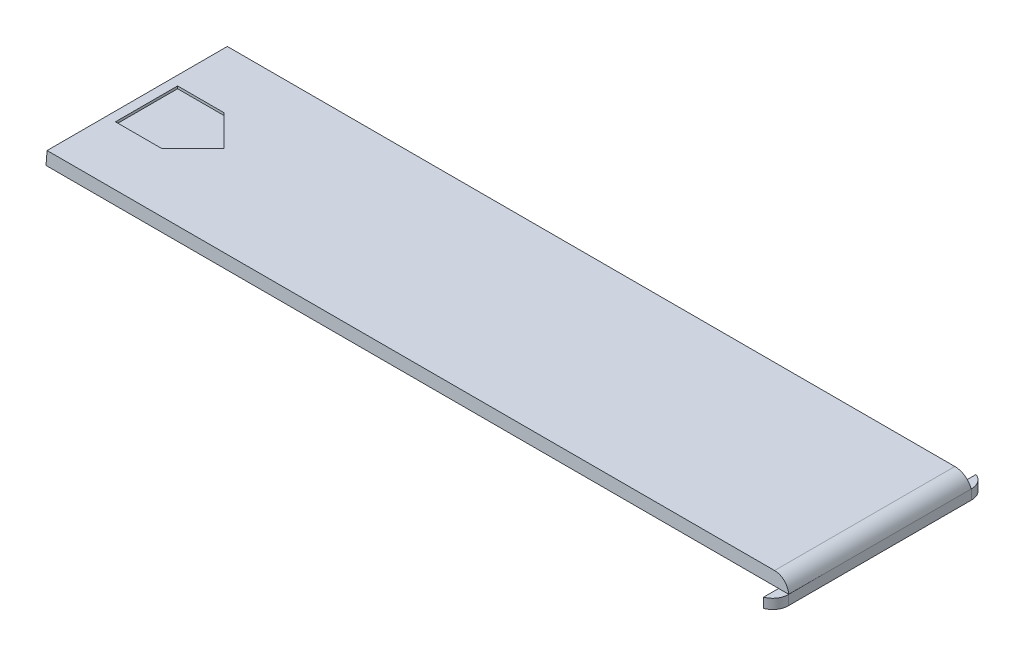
ISO-10303-21;
HEADER;
FILE_DESCRIPTION(('STEP AP214'),'2;1');
FILE_NAME('part.step','',(''),(''),'','','');
FILE_SCHEMA(('AUTOMOTIVE_DESIGN { 1 0 10303 214 1 1 1 1 }'));
ENDSEC;
DATA;
#1=APPLICATION_CONTEXT('core data for automotive mechanical design processes');
#2=APPLICATION_PROTOCOL_DEFINITION('international standard','automotive_design',2000,#1);
#3=PRODUCT_CONTEXT('',#1,'mechanical');
#4=PRODUCT('Part','Part','',(#3));
#5=PRODUCT_RELATED_PRODUCT_CATEGORY('part','',(#4));
#6=PRODUCT_DEFINITION_FORMATION('','',#4);
#7=PRODUCT_DEFINITION_CONTEXT('part definition',#1,'design');
#8=PRODUCT_DEFINITION('design','',#6,#7);
#9=PRODUCT_DEFINITION_SHAPE('','',#8);
#10=(LENGTH_UNIT() NAMED_UNIT(*) SI_UNIT(.MILLI.,.METRE.));
#11=(NAMED_UNIT(*) PLANE_ANGLE_UNIT() SI_UNIT($,.RADIAN.));
#12=(NAMED_UNIT(*) SI_UNIT($,.STERADIAN.) SOLID_ANGLE_UNIT());
#13=UNCERTAINTY_MEASURE_WITH_UNIT(LENGTH_MEASURE(1.E-05),#10,'distance_accuracy_value','');
#14=(GEOMETRIC_REPRESENTATION_CONTEXT(3) GLOBAL_UNCERTAINTY_ASSIGNED_CONTEXT((#13)) GLOBAL_UNIT_ASSIGNED_CONTEXT((#10,
#11,#12)) REPRESENTATION_CONTEXT('',''));
#15=CARTESIAN_POINT('',(0.,0.,0.));
#16=DIRECTION('',(0.,0.,1.));
#17=DIRECTION('',(1.,0.,0.));
#18=AXIS2_PLACEMENT_3D('',#15,#16,#17);
#19=CARTESIAN_POINT('',(0.,0.,0.));
#20=DIRECTION('',(0.,-1.,0.));
#21=DIRECTION('',(0.,0.,-1.));
#22=AXIS2_PLACEMENT_3D('',#19,#20,#21);
#23=PLANE('',#22);
#24=DIRECTION('',(1.,0.,0.));
#25=VECTOR('',#24,1.);
#26=CARTESIAN_POINT('',(-121.868681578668,0.,-11.3537769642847));
#27=LINE('',#26,#25);
#28=CARTESIAN_POINT('',(-121.412,0.,-11.3537769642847));
#29=VERTEX_POINT('',#28);
#30=CARTESIAN_POINT('',(-120.344681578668,0.,-11.3537769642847));
#31=VERTEX_POINT('',#30);
#32=EDGE_CURVE('E257',#29,#31,#27,.T.);
#33=ORIENTED_EDGE('',*,*,#32,.T.);
#34=CARTESIAN_POINT('',(-120.344681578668,0.,-12.6237769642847));
#35=DIRECTION('',(0.,1.,0.));
#36=DIRECTION('',(0.,0.,1.));
#37=AXIS2_PLACEMENT_3D('',#34,#35,#36);
#38=CIRCLE('',#37,1.26999999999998);
#39=CARTESIAN_POINT('',(-119.074681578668,0.,-12.6237769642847));
#40=VERTEX_POINT('',#39);
#41=EDGE_CURVE('E222',#31,#40,#38,.T.);
#42=ORIENTED_EDGE('',*,*,#41,.T.);
#43=DIRECTION('',(0.,0.,1.));
#44=VECTOR('',#43,1.);
#45=CARTESIAN_POINT('',(-119.074681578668,0.,-17.1957769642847));
#46=LINE('',#45,#44);
#47=CARTESIAN_POINT('',(-119.074681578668,0.,-17.1957769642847));
#48=VERTEX_POINT('',#47);
#49=EDGE_CURVE('E240',#48,#40,#46,.T.);
#50=ORIENTED_EDGE('',*,*,#49,.F.);
#51=CARTESIAN_POINT('',(-120.344681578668,0.,-17.1957769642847));
#52=DIRECTION('',(0.,1.,0.));
#53=DIRECTION('',(0.,0.,1.));
#54=AXIS2_PLACEMENT_3D('',#51,#52,#53);
#55=CIRCLE('',#54,1.27000000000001);
#56=CARTESIAN_POINT('',(-120.344681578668,0.,-18.4657769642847));
#57=VERTEX_POINT('',#56);
#58=EDGE_CURVE('E243',#48,#57,#55,.T.);
#59=ORIENTED_EDGE('',*,*,#58,.T.);
#60=DIRECTION('',(-1.,0.,0.));
#61=VECTOR('',#60,1.);
#62=CARTESIAN_POINT('',(-120.344681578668,0.,-18.4657769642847));
#63=LINE('',#62,#61);
#64=CARTESIAN_POINT('',(-121.412,0.,-18.4657769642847));
#65=VERTEX_POINT('',#64);
#66=EDGE_CURVE('E247',#57,#65,#63,.T.);
#67=ORIENTED_EDGE('',*,*,#66,.T.);
#68=DIRECTION('',(0.,0.,1.));
#69=VECTOR('',#68,1.);
#70=CARTESIAN_POINT('',(-121.412,0.,-29.8195539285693));
#71=LINE('',#70,#69);
#72=CARTESIAN_POINT('',(-121.412,0.,-29.8195539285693));
#73=VERTEX_POINT('',#72);
#74=EDGE_CURVE('E368',#73,#65,#71,.T.);
#75=ORIENTED_EDGE('',*,*,#74,.F.);
#76=DIRECTION('',(1.,0.,0.));
#77=VECTOR('',#76,1.);
#78=CARTESIAN_POINT('',(-121.412,0.,-29.8195539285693));
#79=LINE('',#78,#77);
#80=CARTESIAN_POINT('',(-1.651,0.,-29.8195539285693));
#81=VERTEX_POINT('',#80);
#82=EDGE_CURVE('E357',#73,#81,#79,.T.);
#83=ORIENTED_EDGE('',*,*,#82,.T.);
#84=DIRECTION('',(0.,0.,1.));
#85=VECTOR('',#84,1.);
#86=CARTESIAN_POINT('',(-1.651,0.,-32.2751212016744));
#87=LINE('',#86,#85);
#88=CARTESIAN_POINT('',(-1.65099999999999,0.,0.));
#89=VERTEX_POINT('',#88);
#90=EDGE_CURVE('E11',#81,#89,#87,.T.);
#91=ORIENTED_EDGE('',*,*,#90,.T.);
#92=DIRECTION('',(1.,0.,0.));
#93=VECTOR('',#92,1.);
#94=CARTESIAN_POINT('',(-121.412,0.,0.));
#95=LINE('',#94,#93);
#96=CARTESIAN_POINT('',(-121.412,0.,0.));
#97=VERTEX_POINT('',#96);
#98=EDGE_CURVE('E367',#97,#89,#95,.T.);
#99=ORIENTED_EDGE('',*,*,#98,.F.);
#100=EDGE_CURVE('E391',#29,#97,#71,.T.);
#101=ORIENTED_EDGE('',*,*,#100,.F.);
#102=EDGE_LOOP('',(#33,#42,#50,#59,#67,#75,#83,#91,#99,#101));
#103=FACE_BOUND('',#102,.T.);
#104=ADVANCED_FACE('F28',(#103),#23,.T.);
#105=CARTESIAN_POINT('',(-121.412,0.,-29.8195539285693));
#106=DIRECTION('',(0.,0.0871557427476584,-0.996194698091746));
#107=DIRECTION('',(0.,0.996194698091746,0.0871557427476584));
#108=AXIS2_PLACEMENT_3D('',#105,#106,#107);
#109=PLANE('',#108);
#110=DIRECTION('',(1.,0.,0.));
#111=VECTOR('',#110,1.);
#112=CARTESIAN_POINT('',(0.,2.032,-29.6417769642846));
#113=LINE('',#112,#111);
#114=CARTESIAN_POINT('',(-121.412,2.032,-29.6417769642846));
#115=VERTEX_POINT('',#114);
#116=CARTESIAN_POINT('',(-2.48868157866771,2.032,-29.6417769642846));
#117=VERTEX_POINT('',#116);
#118=EDGE_CURVE('E373',#115,#117,#113,.T.);
#119=ORIENTED_EDGE('',*,*,#118,.T.);
#120=CARTESIAN_POINT('',(-2.48868157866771,-0.508,-29.8639981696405));
#121=DIRECTION('',(0.,0.0871557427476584,-0.996194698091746));
#122=DIRECTION('',(0.,0.996194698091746,0.0871557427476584));
#123=AXIS2_PLACEMENT_3D('',#120,#121,#122);
#124=ELLIPSE('',#123,2.5497023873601,2.54);
#125=CARTESIAN_POINT('',(0.,0.,-29.8195539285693));
#126=VERTEX_POINT('',#125);
#127=EDGE_CURVE('E388',#117,#126,#124,.T.);
#128=ORIENTED_EDGE('',*,*,#127,.T.);
#129=EDGE_CURVE('E355',#81,#126,#79,.T.);
#130=ORIENTED_EDGE('',*,*,#129,.F.);
#131=ORIENTED_EDGE('',*,*,#82,.F.);
#132=DIRECTION('',(0.,-0.996194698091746,-0.0871557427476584));
#133=VECTOR('',#132,1.);
#134=CARTESIAN_POINT('',(-121.412,0.,-29.8195539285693));
#135=LINE('',#134,#133);
#136=EDGE_CURVE('E380',#115,#73,#135,.T.);
#137=ORIENTED_EDGE('',*,*,#136,.F.);
#138=EDGE_LOOP('',(#119,#128,#130,#131,#137));
#139=FACE_BOUND('',#138,.T.);
#140=ADVANCED_FACE('F30',(#139),#109,.T.);
#141=CARTESIAN_POINT('',(-121.412,2.032,-29.8195539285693));
#142=DIRECTION('',(1.,0.,0.));
#143=DIRECTION('',(0.,0.,-1.));
#144=AXIS2_PLACEMENT_3D('',#141,#142,#143);
#145=PLANE('',#144);
#146=ORIENTED_EDGE('',*,*,#74,.T.);
#147=EDGE_CURVE('E395',#65,#29,#71,.T.);
#148=ORIENTED_EDGE('',*,*,#147,.T.);
#149=ORIENTED_EDGE('',*,*,#100,.T.);
#150=DIRECTION('',(0.,0.996194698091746,-0.0871557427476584));
#151=VECTOR('',#150,1.);
#152=CARTESIAN_POINT('',(-121.412,0.,0.));
#153=LINE('',#152,#151);
#154=CARTESIAN_POINT('',(-121.412,2.032,-0.177776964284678));
#155=VERTEX_POINT('',#154);
#156=EDGE_CURVE('E377',#155,#97,#153,.F.);
#157=ORIENTED_EDGE('',*,*,#156,.F.);
#158=DIRECTION('',(0.,0.,1.));
#159=VECTOR('',#158,1.);
#160=CARTESIAN_POINT('',(-121.412,2.032,-29.8195539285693));
#161=LINE('',#160,#159);
#162=EDGE_CURVE('E374',#115,#155,#161,.T.);
#163=ORIENTED_EDGE('',*,*,#162,.F.);
#164=ORIENTED_EDGE('',*,*,#136,.T.);
#165=EDGE_LOOP('',(#146,#148,#149,#157,#163,#164));
#166=FACE_BOUND('',#165,.T.);
#167=ADVANCED_FACE('F401',(#166),#145,.F.);
#168=CARTESIAN_POINT('',(-121.412,0.,0.));
#169=DIRECTION('',(0.,0.0871557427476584,0.996194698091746));
#170=DIRECTION('',(0.,-0.996194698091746,0.0871557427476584));
#171=AXIS2_PLACEMENT_3D('',#168,#169,#170);
#172=PLANE('',#171);
#173=ORIENTED_EDGE('',*,*,#98,.T.);
#174=CARTESIAN_POINT('',(0.,0.,0.));
#175=VERTEX_POINT('',#174);
#176=EDGE_CURVE('E365',#89,#175,#95,.T.);
#177=ORIENTED_EDGE('',*,*,#176,.T.);
#178=CARTESIAN_POINT('',(-2.48868157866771,-0.508,0.0444442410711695));
#179=DIRECTION('',(0.,0.0871557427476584,0.996194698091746));
#180=DIRECTION('',(0.,-0.996194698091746,0.0871557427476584));
#181=AXIS2_PLACEMENT_3D('',#178,#179,#180);
#182=ELLIPSE('',#181,2.5497023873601,2.54);
#183=CARTESIAN_POINT('',(-2.48868157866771,2.032,-0.177776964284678));
#184=VERTEX_POINT('',#183);
#185=EDGE_CURVE('E37',#175,#184,#182,.T.);
#186=ORIENTED_EDGE('',*,*,#185,.T.);
#187=DIRECTION('',(-1.,0.,0.));
#188=VECTOR('',#187,1.);
#189=CARTESIAN_POINT('',(0.,2.032,-0.177776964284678));
#190=LINE('',#189,#188);
#191=EDGE_CURVE('E376',#155,#184,#190,.F.);
#192=ORIENTED_EDGE('',*,*,#191,.F.);
#193=ORIENTED_EDGE('',*,*,#156,.T.);
#194=EDGE_LOOP('',(#173,#177,#186,#192,#193));
#195=FACE_BOUND('',#194,.T.);
#196=ADVANCED_FACE('F417',(#195),#172,.T.);
#197=CARTESIAN_POINT('',(0.,2.032,0.));
#198=DIRECTION('',(0.,-1.,0.));
#199=DIRECTION('',(0.,0.,-1.));
#200=AXIS2_PLACEMENT_3D('',#197,#198,#199);
#201=PLANE('',#200);
#202=DIRECTION('',(-1.,0.,0.));
#203=VECTOR('',#202,1.);
#204=CARTESIAN_POINT('',(-112.268,2.03199999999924,-19.9897769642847));
#205=LINE('',#204,#203);
#206=CARTESIAN_POINT('',(-112.268,2.032,-19.9897769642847));
#207=VERTEX_POINT('',#206);
#208=CARTESIAN_POINT('',(-119.888,2.03199999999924,-19.9897769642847));
#209=VERTEX_POINT('',#208);
#210=EDGE_CURVE('E203',#207,#209,#205,.T.);
#211=ORIENTED_EDGE('',*,*,#210,.F.);
#212=DIRECTION('',(-0.707106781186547,0.,-0.707106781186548));
#213=VECTOR('',#212,1.);
#214=CARTESIAN_POINT('',(-107.188,2.03199999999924,-14.9097769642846));
#215=LINE('',#214,#213);
#216=CARTESIAN_POINT('',(-107.188,2.03199999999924,-14.9097769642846));
#217=VERTEX_POINT('',#216);
#218=EDGE_CURVE('E47',#217,#207,#215,.T.);
#219=ORIENTED_EDGE('',*,*,#218,.F.);
#220=DIRECTION('',(0.707106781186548,0.,-0.707106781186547));
#221=VECTOR('',#220,1.);
#222=CARTESIAN_POINT('',(-112.268,2.03199999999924,-9.82977696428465));
#223=LINE('',#222,#221);
#224=CARTESIAN_POINT('',(-112.268,2.03199999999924,-9.82977696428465));
#225=VERTEX_POINT('',#224);
#226=EDGE_CURVE('E213',#225,#217,#223,.T.);
#227=ORIENTED_EDGE('',*,*,#226,.F.);
#228=DIRECTION('',(1.,0.,0.));
#229=VECTOR('',#228,1.);
#230=CARTESIAN_POINT('',(-119.888,2.03199999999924,-9.82977696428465));
#231=LINE('',#230,#229);
#232=CARTESIAN_POINT('',(-119.888,2.03199999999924,-9.82977696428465));
#233=VERTEX_POINT('',#232);
#234=EDGE_CURVE('E211',#233,#225,#231,.T.);
#235=ORIENTED_EDGE('',*,*,#234,.F.);
#236=DIRECTION('',(0.,0.,-1.));
#237=VECTOR('',#236,1.);
#238=CARTESIAN_POINT('',(-119.888,2.03199999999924,-9.82977696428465));
#239=LINE('',#238,#237);
#240=EDGE_CURVE('E192',#233,#209,#239,.T.);
#241=ORIENTED_EDGE('',*,*,#240,.T.);
#242=EDGE_LOOP('',(#211,#219,#227,#235,#241));
#243=FACE_BOUND('',#242,.T.);
#244=ORIENTED_EDGE('',*,*,#191,.T.);
#245=DIRECTION('',(0.,0.,1.));
#246=VECTOR('',#245,1.);
#247=CARTESIAN_POINT('',(-2.48868157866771,2.032,0.));
#248=LINE('',#247,#246);
#249=EDGE_CURVE('E386',#184,#117,#248,.F.);
#250=ORIENTED_EDGE('',*,*,#249,.T.);
#251=ORIENTED_EDGE('',*,*,#118,.F.);
#252=ORIENTED_EDGE('',*,*,#162,.T.);
#253=EDGE_LOOP('',(#244,#250,#251,#252));
#254=FACE_BOUND('',#253,.T.);
#255=ADVANCED_FACE('F207',(#243,#254),#201,.F.);
#256=CARTESIAN_POINT('',(-2.48868157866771,-0.508,0.));
#257=DIRECTION('',(0.,0.,1.));
#258=DIRECTION('',(1.,0.,0.));
#259=AXIS2_PLACEMENT_3D('',#256,#257,#258);
#260=CYLINDRICAL_SURFACE('',#259,2.54);
#261=ORIENTED_EDGE('',*,*,#185,.F.);
#262=DIRECTION('',(0.,0.,-1.));
#263=VECTOR('',#262,1.);
#264=CARTESIAN_POINT('',(0.,0.,0.));
#265=LINE('',#264,#263);
#266=EDGE_CURVE('E315',#175,#126,#265,.T.);
#267=ORIENTED_EDGE('',*,*,#266,.T.);
#268=ORIENTED_EDGE('',*,*,#127,.F.);
#269=ORIENTED_EDGE('',*,*,#249,.F.);
#270=EDGE_LOOP('',(#261,#267,#268,#269));
#271=FACE_BOUND('',#270,.T.);
#272=ADVANCED_FACE('F421',(#271),#260,.T.);
#273=CARTESIAN_POINT('',(-2.54,0.,-29.8957769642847));
#274=DIRECTION('',(0.,-1.,0.));
#275=DIRECTION('',(0.,0.,-1.));
#276=AXIS2_PLACEMENT_3D('',#273,#274,#275);
#277=PLANE('',#276);
#278=CARTESIAN_POINT('',(-1.651,0.,-32.2751212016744));
#279=VERTEX_POINT('',#278);
#280=EDGE_CURVE('E39',#279,#81,#87,.T.);
#281=ORIENTED_EDGE('',*,*,#280,.T.);
#282=ORIENTED_EDGE('',*,*,#129,.T.);
#283=DIRECTION('',(0.,0.,-1.));
#284=VECTOR('',#283,1.);
#285=CARTESIAN_POINT('',(0.,0.,0.0762230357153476));
#286=LINE('',#285,#284);
#287=CARTESIAN_POINT('',(0.,0.,-29.8957769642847));
#288=VERTEX_POINT('',#287);
#289=EDGE_CURVE('E301',#126,#288,#286,.T.);
#290=ORIENTED_EDGE('',*,*,#289,.T.);
#291=CARTESIAN_POINT('',(-2.54,0.,-29.8957769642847));
#292=DIRECTION('',(0.,-1.,0.));
#293=DIRECTION('',(0.,0.,-1.));
#294=AXIS2_PLACEMENT_3D('',#291,#292,#293);
#295=CIRCLE('',#294,2.54);
#296=EDGE_CURVE('E283',#279,#288,#295,.T.);
#297=ORIENTED_EDGE('',*,*,#296,.F.);
#298=EDGE_LOOP('',(#281,#282,#290,#297));
#299=FACE_BOUND('',#298,.T.);
#300=ADVANCED_FACE('F406',(#299),#277,.F.);
#301=CARTESIAN_POINT('',(-2.54,-1.6002,-29.8957769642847));
#302=DIRECTION('',(0.,1.,0.));
#303=DIRECTION('',(0.,0.,1.));
#304=AXIS2_PLACEMENT_3D('',#301,#302,#303);
#305=CYLINDRICAL_SURFACE('',#304,2.54);
#306=ORIENTED_EDGE('',*,*,#296,.T.);
#307=DIRECTION('',(0.,1.,0.));
#308=VECTOR('',#307,1.);
#309=CARTESIAN_POINT('',(0.,-1.6002,-29.8957769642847));
#310=LINE('',#309,#308);
#311=CARTESIAN_POINT('',(0.,-1.6002,-29.8957769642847));
#312=VERTEX_POINT('',#311);
#313=EDGE_CURVE('E312',#312,#288,#310,.T.);
#314=ORIENTED_EDGE('',*,*,#313,.F.);
#315=CARTESIAN_POINT('',(-2.54,-1.6002,-29.8957769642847));
#316=DIRECTION('',(0.,-1.,0.));
#317=DIRECTION('',(0.,0.,-1.));
#318=AXIS2_PLACEMENT_3D('',#315,#316,#317);
#319=CIRCLE('',#318,2.54);
#320=CARTESIAN_POINT('',(-1.651,-1.6002,-32.2751212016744));
#321=VERTEX_POINT('',#320);
#322=EDGE_CURVE('E331',#321,#312,#319,.T.);
#323=ORIENTED_EDGE('',*,*,#322,.F.);
#324=DIRECTION('',(0.,1.,0.));
#325=VECTOR('',#324,1.);
#326=CARTESIAN_POINT('',(-1.651,-1.6002,-32.2751212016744));
#327=LINE('',#326,#325);
#328=EDGE_CURVE('E321',#321,#279,#327,.T.);
#329=ORIENTED_EDGE('',*,*,#328,.T.);
#330=EDGE_LOOP('',(#306,#314,#323,#329));
#331=FACE_BOUND('',#330,.T.);
#332=ADVANCED_FACE('F411',(#331),#305,.T.);
#333=CARTESIAN_POINT('',(0.,-1.6002,0.0762230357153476));
#334=DIRECTION('',(1.,0.,0.));
#335=DIRECTION('',(0.,0.,-1.));
#336=AXIS2_PLACEMENT_3D('',#333,#334,#335);
#337=PLANE('',#336);
#338=CARTESIAN_POINT('',(0.,0.,0.0762230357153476));
#339=VERTEX_POINT('',#338);
#340=EDGE_CURVE('E309',#339,#175,#286,.T.);
#341=ORIENTED_EDGE('',*,*,#340,.F.);
#342=DIRECTION('',(0.,1.,0.));
#343=VECTOR('',#342,1.);
#344=CARTESIAN_POINT('',(0.,-1.6002,0.0762230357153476));
#345=LINE('',#344,#343);
#346=CARTESIAN_POINT('',(0.,-1.6002,0.0762230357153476));
#347=VERTEX_POINT('',#346);
#348=EDGE_CURVE('E316',#347,#339,#345,.T.);
#349=ORIENTED_EDGE('',*,*,#348,.F.);
#350=DIRECTION('',(0.,0.,-1.));
#351=VECTOR('',#350,1.);
#352=CARTESIAN_POINT('',(0.,-1.6002,0.0762230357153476));
#353=LINE('',#352,#351);
#354=EDGE_CURVE('E328',#347,#312,#353,.T.);
#355=ORIENTED_EDGE('',*,*,#354,.T.);
#356=ORIENTED_EDGE('',*,*,#313,.T.);
#357=ORIENTED_EDGE('',*,*,#289,.F.);
#358=ORIENTED_EDGE('',*,*,#266,.F.);
#359=EDGE_LOOP('',(#341,#349,#355,#356,#357,#358));
#360=FACE_BOUND('',#359,.T.);
#361=ADVANCED_FACE('F349',(#360),#337,.T.);
#362=CARTESIAN_POINT('',(-2.53999999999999,-1.6002,0.0762230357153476));
#363=DIRECTION('',(0.,1.,0.));
#364=DIRECTION('',(0.,0.,1.));
#365=AXIS2_PLACEMENT_3D('',#362,#363,#364);
#366=CYLINDRICAL_SURFACE('',#365,2.54);
#367=CARTESIAN_POINT('',(-2.53999999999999,0.,0.0762230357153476));
#368=DIRECTION('',(0.,-1.,0.));
#369=DIRECTION('',(0.,0.,-1.));
#370=AXIS2_PLACEMENT_3D('',#367,#368,#369);
#371=CIRCLE('',#370,2.54);
#372=CARTESIAN_POINT('',(-1.65099999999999,0.,2.45556727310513));
#373=VERTEX_POINT('',#372);
#374=EDGE_CURVE('E304',#339,#373,#371,.T.);
#375=ORIENTED_EDGE('',*,*,#374,.T.);
#376=DIRECTION('',(0.,1.,0.));
#377=VECTOR('',#376,1.);
#378=CARTESIAN_POINT('',(-1.65099999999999,-1.6002,2.45556727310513));
#379=LINE('',#378,#377);
#380=CARTESIAN_POINT('',(-1.65099999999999,-1.6002,2.45556727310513));
#381=VERTEX_POINT('',#380);
#382=EDGE_CURVE('E318',#381,#373,#379,.T.);
#383=ORIENTED_EDGE('',*,*,#382,.F.);
#384=CARTESIAN_POINT('',(-2.53999999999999,-1.6002,0.0762230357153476));
#385=DIRECTION('',(0.,-1.,0.));
#386=DIRECTION('',(0.,0.,-1.));
#387=AXIS2_PLACEMENT_3D('',#384,#385,#386);
#388=CIRCLE('',#387,2.54);
#389=EDGE_CURVE('E326',#347,#381,#388,.T.);
#390=ORIENTED_EDGE('',*,*,#389,.F.);
#391=ORIENTED_EDGE('',*,*,#348,.T.);
#392=EDGE_LOOP('',(#375,#383,#390,#391));
#393=FACE_BOUND('',#392,.T.);
#394=ADVANCED_FACE('F343',(#393),#366,.T.);
#395=CARTESIAN_POINT('',(-1.651,-1.6002,-32.2751212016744));
#396=DIRECTION('',(-1.,0.,0.));
#397=DIRECTION('',(0.,0.,1.));
#398=AXIS2_PLACEMENT_3D('',#395,#396,#397);
#399=PLANE('',#398);
#400=ORIENTED_EDGE('',*,*,#280,.F.);
#401=ORIENTED_EDGE('',*,*,#328,.F.);
#402=DIRECTION('',(0.,0.,1.));
#403=VECTOR('',#402,1.);
#404=CARTESIAN_POINT('',(-1.651,-1.6002,-32.2751212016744));
#405=LINE('',#404,#403);
#406=EDGE_CURVE('E323',#321,#381,#405,.T.);
#407=ORIENTED_EDGE('',*,*,#406,.T.);
#408=ORIENTED_EDGE('',*,*,#382,.T.);
#409=EDGE_CURVE('E40',#89,#373,#87,.T.);
#410=ORIENTED_EDGE('',*,*,#409,.F.);
#411=ORIENTED_EDGE('',*,*,#90,.F.);
#412=EDGE_LOOP('',(#400,#401,#407,#408,#410,#411));
#413=FACE_BOUND('',#412,.T.);
#414=ADVANCED_FACE('F414',(#413),#399,.T.);
#415=CARTESIAN_POINT('',(-2.54,-1.6002,-29.8957769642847));
#416=DIRECTION('',(0.,-1.,0.));
#417=DIRECTION('',(0.,0.,-1.));
#418=AXIS2_PLACEMENT_3D('',#415,#416,#417);
#419=PLANE('',#418);
#420=ORIENTED_EDGE('',*,*,#322,.T.);
#421=ORIENTED_EDGE('',*,*,#354,.F.);
#422=ORIENTED_EDGE('',*,*,#389,.T.);
#423=ORIENTED_EDGE('',*,*,#406,.F.);
#424=EDGE_LOOP('',(#420,#421,#422,#423));
#425=FACE_BOUND('',#424,.T.);
#426=ADVANCED_FACE('F580',(#425),#419,.T.);
#427=ORIENTED_EDGE('',*,*,#176,.F.);
#428=ORIENTED_EDGE('',*,*,#409,.T.);
#429=ORIENTED_EDGE('',*,*,#374,.F.);
#430=ORIENTED_EDGE('',*,*,#340,.T.);
#431=EDGE_LOOP('',(#427,#428,#429,#430));
#432=FACE_BOUND('',#431,.T.);
#433=ADVANCED_FACE('F346',(#432),#277,.F.);
#434=CARTESIAN_POINT('',(-120.344681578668,0.,-12.6237769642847));
#435=DIRECTION('',(0.,1.,0.));
#436=DIRECTION('',(0.,0.,1.));
#437=AXIS2_PLACEMENT_3D('',#434,#435,#436);
#438=PLANE('',#437);
#439=ORIENTED_EDGE('',*,*,#147,.F.);
#440=CARTESIAN_POINT('',(-121.868681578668,0.,-18.4657769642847));
#441=VERTEX_POINT('',#440);
#442=EDGE_CURVE('E246',#65,#441,#63,.T.);
#443=ORIENTED_EDGE('',*,*,#442,.T.);
#444=CARTESIAN_POINT('',(-121.868681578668,0.,-17.1957769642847));
#445=DIRECTION('',(0.,-1.,0.));
#446=DIRECTION('',(0.,0.,-1.));
#447=AXIS2_PLACEMENT_3D('',#444,#445,#446);
#448=CIRCLE('',#447,1.27);
#449=CARTESIAN_POINT('',(-123.138681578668,0.,-17.1957769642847));
#450=VERTEX_POINT('',#449);
#451=EDGE_CURVE('E250',#450,#441,#448,.T.);
#452=ORIENTED_EDGE('',*,*,#451,.F.);
#453=DIRECTION('',(0.,0.,-1.));
#454=VECTOR('',#453,1.);
#455=CARTESIAN_POINT('',(-123.138681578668,0.,-12.6237769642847));
#456=LINE('',#455,#454);
#457=CARTESIAN_POINT('',(-123.138681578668,0.,-12.6237769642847));
#458=VERTEX_POINT('',#457);
#459=EDGE_CURVE('E253',#458,#450,#456,.T.);
#460=ORIENTED_EDGE('',*,*,#459,.F.);
#461=CARTESIAN_POINT('',(-121.868681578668,0.,-12.6237769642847));
#462=DIRECTION('',(0.,1.,0.));
#463=DIRECTION('',(0.,0.,1.));
#464=AXIS2_PLACEMENT_3D('',#461,#462,#463);
#465=CIRCLE('',#464,1.27);
#466=CARTESIAN_POINT('',(-121.868681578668,0.,-11.3537769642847));
#467=VERTEX_POINT('',#466);
#468=EDGE_CURVE('E255',#458,#467,#465,.T.);
#469=ORIENTED_EDGE('',*,*,#468,.T.);
#470=EDGE_CURVE('E55',#467,#29,#27,.T.);
#471=ORIENTED_EDGE('',*,*,#470,.T.);
#472=EDGE_LOOP('',(#439,#443,#452,#460,#469,#471));
#473=FACE_BOUND('',#472,.T.);
#474=ADVANCED_FACE('F454',(#473),#438,.T.);
#475=CARTESIAN_POINT('',(-120.344681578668,-1.905,-12.6237769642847));
#476=DIRECTION('',(0.,1.,0.));
#477=DIRECTION('',(0.,0.,1.));
#478=AXIS2_PLACEMENT_3D('',#475,#476,#477);
#479=CYLINDRICAL_SURFACE('',#478,1.26999999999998);
#480=ORIENTED_EDGE('',*,*,#41,.F.);
#481=DIRECTION('',(0.,1.,0.));
#482=VECTOR('',#481,1.);
#483=CARTESIAN_POINT('',(-120.344681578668,-1.905,-11.3537769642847));
#484=LINE('',#483,#482);
#485=CARTESIAN_POINT('',(-120.344681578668,-1.905,-11.3537769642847));
#486=VERTEX_POINT('',#485);
#487=EDGE_CURVE('E281',#486,#31,#484,.T.);
#488=ORIENTED_EDGE('',*,*,#487,.F.);
#489=CARTESIAN_POINT('',(-120.344681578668,-1.905,-12.6237769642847));
#490=DIRECTION('',(0.,1.,0.));
#491=DIRECTION('',(0.,0.,1.));
#492=AXIS2_PLACEMENT_3D('',#489,#490,#491);
#493=CIRCLE('',#492,1.26999999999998);
#494=CARTESIAN_POINT('',(-119.074681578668,-1.905,-12.6237769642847));
#495=VERTEX_POINT('',#494);
#496=EDGE_CURVE('E259',#486,#495,#493,.T.);
#497=ORIENTED_EDGE('',*,*,#496,.T.);
#498=DIRECTION('',(0.,1.,0.));
#499=VECTOR('',#498,1.);
#500=CARTESIAN_POINT('',(-119.074681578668,-1.905,-12.6237769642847));
#501=LINE('',#500,#499);
#502=EDGE_CURVE('E280',#495,#40,#501,.T.);
#503=ORIENTED_EDGE('',*,*,#502,.T.);
#504=EDGE_LOOP('',(#480,#488,#497,#503));
#505=FACE_BOUND('',#504,.T.);
#506=ADVANCED_FACE('F458',(#505),#479,.T.);
#507=CARTESIAN_POINT('',(-121.868681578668,-1.905,-11.3537769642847));
#508=DIRECTION('',(0.,0.,1.));
#509=DIRECTION('',(1.,0.,0.));
#510=AXIS2_PLACEMENT_3D('',#507,#508,#509);
#511=PLANE('',#510);
#512=ORIENTED_EDGE('',*,*,#470,.F.);
#513=DIRECTION('',(0.,1.,0.));
#514=VECTOR('',#513,1.);
#515=CARTESIAN_POINT('',(-121.868681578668,-1.905,-11.3537769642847));
#516=LINE('',#515,#514);
#517=CARTESIAN_POINT('',(-121.868681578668,-1.905,-11.3537769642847));
#518=VERTEX_POINT('',#517);
#519=EDGE_CURVE('E284',#518,#467,#516,.T.);
#520=ORIENTED_EDGE('',*,*,#519,.F.);
#521=DIRECTION('',(1.,0.,0.));
#522=VECTOR('',#521,1.);
#523=CARTESIAN_POINT('',(-121.868681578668,-1.905,-11.3537769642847));
#524=LINE('',#523,#522);
#525=EDGE_CURVE('E277',#518,#486,#524,.T.);
#526=ORIENTED_EDGE('',*,*,#525,.T.);
#527=ORIENTED_EDGE('',*,*,#487,.T.);
#528=ORIENTED_EDGE('',*,*,#32,.F.);
#529=EDGE_LOOP('',(#512,#520,#526,#527,#528));
#530=FACE_BOUND('',#529,.T.);
#531=ADVANCED_FACE('F466',(#530),#511,.T.);
#532=CARTESIAN_POINT('',(-121.868681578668,-1.905,-12.6237769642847));
#533=DIRECTION('',(0.,1.,0.));
#534=DIRECTION('',(0.,0.,1.));
#535=AXIS2_PLACEMENT_3D('',#532,#533,#534);
#536=CYLINDRICAL_SURFACE('',#535,1.27);
#537=ORIENTED_EDGE('',*,*,#468,.F.);
#538=DIRECTION('',(0.,1.,0.));
#539=VECTOR('',#538,1.);
#540=CARTESIAN_POINT('',(-123.138681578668,-1.905,-12.6237769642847));
#541=LINE('',#540,#539);
#542=CARTESIAN_POINT('',(-123.138681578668,-1.905,-12.6237769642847));
#543=VERTEX_POINT('',#542);
#544=EDGE_CURVE('E286',#543,#458,#541,.T.);
#545=ORIENTED_EDGE('',*,*,#544,.F.);
#546=CARTESIAN_POINT('',(-121.868681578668,-1.905,-12.6237769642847));
#547=DIRECTION('',(0.,1.,0.));
#548=DIRECTION('',(0.,0.,1.));
#549=AXIS2_PLACEMENT_3D('',#546,#547,#548);
#550=CIRCLE('',#549,1.27);
#551=EDGE_CURVE('E274',#543,#518,#550,.T.);
#552=ORIENTED_EDGE('',*,*,#551,.T.);
#553=ORIENTED_EDGE('',*,*,#519,.T.);
#554=EDGE_LOOP('',(#537,#545,#552,#553));
#555=FACE_BOUND('',#554,.T.);
#556=ADVANCED_FACE('F474',(#555),#536,.T.);
#557=CARTESIAN_POINT('',(-123.138681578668,-1.905,-12.6237769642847));
#558=DIRECTION('',(1.,0.,0.));
#559=DIRECTION('',(0.,0.,-1.));
#560=AXIS2_PLACEMENT_3D('',#557,#558,#559);
#561=PLANE('',#560);
#562=ORIENTED_EDGE('',*,*,#459,.T.);
#563=DIRECTION('',(0.,1.,0.));
#564=VECTOR('',#563,1.);
#565=CARTESIAN_POINT('',(-123.138681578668,-1.905,-17.1957769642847));
#566=LINE('',#565,#564);
#567=CARTESIAN_POINT('',(-123.138681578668,-1.905,-17.1957769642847));
#568=VERTEX_POINT('',#567);
#569=EDGE_CURVE('E288',#568,#450,#566,.T.);
#570=ORIENTED_EDGE('',*,*,#569,.F.);
#571=DIRECTION('',(0.,0.,-1.));
#572=VECTOR('',#571,1.);
#573=CARTESIAN_POINT('',(-123.138681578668,-1.905,-12.6237769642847));
#574=LINE('',#573,#572);
#575=EDGE_CURVE('E272',#543,#568,#574,.T.);
#576=ORIENTED_EDGE('',*,*,#575,.F.);
#577=ORIENTED_EDGE('',*,*,#544,.T.);
#578=EDGE_LOOP('',(#562,#570,#576,#577));
#579=FACE_BOUND('',#578,.T.);
#580=ADVANCED_FACE('F482',(#579),#561,.F.);
#581=CARTESIAN_POINT('',(-121.868681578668,-1.905,-17.1957769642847));
#582=DIRECTION('',(0.,1.,0.));
#583=DIRECTION('',(0.,0.,1.));
#584=AXIS2_PLACEMENT_3D('',#581,#582,#583);
#585=CYLINDRICAL_SURFACE('',#584,1.27);
#586=ORIENTED_EDGE('',*,*,#451,.T.);
#587=DIRECTION('',(0.,1.,0.));
#588=VECTOR('',#587,1.);
#589=CARTESIAN_POINT('',(-121.868681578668,-1.905,-18.4657769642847));
#590=LINE('',#589,#588);
#591=CARTESIAN_POINT('',(-121.868681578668,-1.905,-18.4657769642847));
#592=VERTEX_POINT('',#591);
#593=EDGE_CURVE('E291',#592,#441,#590,.T.);
#594=ORIENTED_EDGE('',*,*,#593,.F.);
#595=CARTESIAN_POINT('',(-121.868681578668,-1.905,-17.1957769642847));
#596=DIRECTION('',(0.,-1.,0.));
#597=DIRECTION('',(0.,0.,-1.));
#598=AXIS2_PLACEMENT_3D('',#595,#596,#597);
#599=CIRCLE('',#598,1.27);
#600=EDGE_CURVE('E270',#568,#592,#599,.T.);
#601=ORIENTED_EDGE('',*,*,#600,.F.);
#602=ORIENTED_EDGE('',*,*,#569,.T.);
#603=EDGE_LOOP('',(#586,#594,#601,#602));
#604=FACE_BOUND('',#603,.T.);
#605=ADVANCED_FACE('F490',(#604),#585,.T.);
#606=CARTESIAN_POINT('',(-120.344681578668,-1.905,-18.4657769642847));
#607=DIRECTION('',(0.,0.,-1.));
#608=DIRECTION('',(-1.,0.,0.));
#609=AXIS2_PLACEMENT_3D('',#606,#607,#608);
#610=PLANE('',#609);
#611=ORIENTED_EDGE('',*,*,#66,.F.);
#612=DIRECTION('',(0.,1.,0.));
#613=VECTOR('',#612,1.);
#614=CARTESIAN_POINT('',(-120.344681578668,-1.905,-18.4657769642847));
#615=LINE('',#614,#613);
#616=CARTESIAN_POINT('',(-120.344681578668,-1.905,-18.4657769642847));
#617=VERTEX_POINT('',#616);
#618=EDGE_CURVE('E294',#617,#57,#615,.T.);
#619=ORIENTED_EDGE('',*,*,#618,.F.);
#620=DIRECTION('',(-1.,0.,0.));
#621=VECTOR('',#620,1.);
#622=CARTESIAN_POINT('',(-120.344681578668,-1.905,-18.4657769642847));
#623=LINE('',#622,#621);
#624=EDGE_CURVE('E267',#617,#592,#623,.T.);
#625=ORIENTED_EDGE('',*,*,#624,.T.);
#626=ORIENTED_EDGE('',*,*,#593,.T.);
#627=ORIENTED_EDGE('',*,*,#442,.F.);
#628=EDGE_LOOP('',(#611,#619,#625,#626,#627));
#629=FACE_BOUND('',#628,.T.);
#630=ADVANCED_FACE('F498',(#629),#610,.T.);
#631=CARTESIAN_POINT('',(-120.344681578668,-1.905,-17.1957769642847));
#632=DIRECTION('',(0.,1.,0.));
#633=DIRECTION('',(0.,0.,1.));
#634=AXIS2_PLACEMENT_3D('',#631,#632,#633);
#635=CYLINDRICAL_SURFACE('',#634,1.27000000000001);
#636=ORIENTED_EDGE('',*,*,#58,.F.);
#637=DIRECTION('',(0.,1.,0.));
#638=VECTOR('',#637,1.);
#639=CARTESIAN_POINT('',(-119.074681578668,-1.905,-17.1957769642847));
#640=LINE('',#639,#638);
#641=CARTESIAN_POINT('',(-119.074681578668,-1.905,-17.1957769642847));
#642=VERTEX_POINT('',#641);
#643=EDGE_CURVE('E296',#642,#48,#640,.T.);
#644=ORIENTED_EDGE('',*,*,#643,.F.);
#645=CARTESIAN_POINT('',(-120.344681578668,-1.905,-17.1957769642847));
#646=DIRECTION('',(0.,1.,0.));
#647=DIRECTION('',(0.,0.,1.));
#648=AXIS2_PLACEMENT_3D('',#645,#646,#647);
#649=CIRCLE('',#648,1.27000000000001);
#650=EDGE_CURVE('E264',#642,#617,#649,.T.);
#651=ORIENTED_EDGE('',*,*,#650,.T.);
#652=ORIENTED_EDGE('',*,*,#618,.T.);
#653=EDGE_LOOP('',(#636,#644,#651,#652));
#654=FACE_BOUND('',#653,.T.);
#655=ADVANCED_FACE('F506',(#654),#635,.T.);
#656=CARTESIAN_POINT('',(-119.074681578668,-1.905,-17.1957769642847));
#657=DIRECTION('',(-1.,0.,0.));
#658=DIRECTION('',(0.,0.,1.));
#659=AXIS2_PLACEMENT_3D('',#656,#657,#658);
#660=PLANE('',#659);
#661=ORIENTED_EDGE('',*,*,#49,.T.);
#662=ORIENTED_EDGE('',*,*,#502,.F.);
#663=DIRECTION('',(0.,0.,1.));
#664=VECTOR('',#663,1.);
#665=CARTESIAN_POINT('',(-119.074681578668,-1.905,-17.1957769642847));
#666=LINE('',#665,#664);
#667=EDGE_CURVE('E262',#642,#495,#666,.T.);
#668=ORIENTED_EDGE('',*,*,#667,.F.);
#669=ORIENTED_EDGE('',*,*,#643,.T.);
#670=EDGE_LOOP('',(#661,#662,#668,#669));
#671=FACE_BOUND('',#670,.T.);
#672=ADVANCED_FACE('F514',(#671),#660,.F.);
#673=CARTESIAN_POINT('',(-120.344681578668,-1.905,-12.6237769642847));
#674=DIRECTION('',(0.,1.,0.));
#675=DIRECTION('',(0.,0.,1.));
#676=AXIS2_PLACEMENT_3D('',#673,#674,#675);
#677=PLANE('',#676);
#678=ORIENTED_EDGE('',*,*,#496,.F.);
#679=ORIENTED_EDGE('',*,*,#525,.F.);
#680=ORIENTED_EDGE('',*,*,#551,.F.);
#681=ORIENTED_EDGE('',*,*,#575,.T.);
#682=ORIENTED_EDGE('',*,*,#600,.T.);
#683=ORIENTED_EDGE('',*,*,#624,.F.);
#684=ORIENTED_EDGE('',*,*,#650,.F.);
#685=ORIENTED_EDGE('',*,*,#667,.T.);
#686=EDGE_LOOP('',(#678,#679,#680,#681,#682,#683,#684,#685));
#687=FACE_BOUND('',#686,.T.);
#688=ADVANCED_FACE('F522',(#687),#677,.F.);
#689=CARTESIAN_POINT('',(-107.188,2.03199999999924,-14.9097769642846));
#690=DIRECTION('',(0.706137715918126,-0.0523359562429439,-0.706137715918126));
#691=DIRECTION('',(-0.707106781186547,0.,-0.707106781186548));
#692=AXIS2_PLACEMENT_3D('',#689,#690,#691);
#693=PLANE('',#692);
#694=ORIENTED_EDGE('',*,*,#218,.T.);
#695=DIRECTION('',(0.0216731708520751,0.998394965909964,-0.052323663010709));
#696=VECTOR('',#695,1.);
#697=CARTESIAN_POINT('',(-112.271374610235,1.87654541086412,-19.9816299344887));
#698=LINE('',#697,#696);
#699=CARTESIAN_POINT('',(-112.276270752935,1.65099999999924,-19.9698096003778));
#700=VERTEX_POINT('',#699);
#701=EDGE_CURVE('E200',#700,#207,#698,.T.);
#702=ORIENTED_EDGE('',*,*,#701,.F.);
#703=DIRECTION('',(-0.707106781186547,0.,-0.707106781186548));
#704=VECTOR('',#703,1.);
#705=CARTESIAN_POINT('',(-107.202119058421,1.65099999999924,-14.8956579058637));
#706=LINE('',#705,#704);
#707=CARTESIAN_POINT('',(-107.216238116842,1.65099999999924,-14.9097769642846));
#708=VERTEX_POINT('',#707);
#709=EDGE_CURVE('E219',#708,#700,#706,.T.);
#710=ORIENTED_EDGE('',*,*,#709,.F.);
#711=DIRECTION('',(0.0739130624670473,0.997264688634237,0.));
#712=VECTOR('',#711,1.);
#713=CARTESIAN_POINT('',(-107.215752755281,1.65754869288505,-14.9097769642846));
#714=LINE('',#713,#712);
#715=EDGE_CURVE('E220',#708,#217,#714,.T.);
#716=ORIENTED_EDGE('',*,*,#715,.T.);
#717=EDGE_LOOP('',(#694,#702,#710,#716));
#718=FACE_BOUND('',#717,.T.);
#719=ADVANCED_FACE('F529',(#718),#693,.F.);
#720=CARTESIAN_POINT('',(-112.268,2.03199999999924,-9.82977696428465));
#721=DIRECTION('',(0.706137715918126,-0.0523359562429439,0.706137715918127));
#722=DIRECTION('',(0.707106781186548,0.,-0.707106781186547));
#723=AXIS2_PLACEMENT_3D('',#720,#721,#722);
#724=PLANE('',#723);
#725=ORIENTED_EDGE('',*,*,#226,.T.);
#726=ORIENTED_EDGE('',*,*,#715,.F.);
#727=DIRECTION('',(0.707106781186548,0.,-0.707106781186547));
#728=VECTOR('',#727,1.);
#729=CARTESIAN_POINT('',(-112.282119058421,1.65099999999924,-9.8438960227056));
#730=LINE('',#729,#728);
#731=CARTESIAN_POINT('',(-112.276270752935,1.65099999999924,-9.84974432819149));
#732=VERTEX_POINT('',#731);
#733=EDGE_CURVE('E224',#732,#708,#730,.T.);
#734=ORIENTED_EDGE('',*,*,#733,.F.);
#735=DIRECTION('',(0.0216731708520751,0.998394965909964,0.052323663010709));
#736=VECTOR('',#735,1.);
#737=CARTESIAN_POINT('',(-112.271579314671,1.86711550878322,-9.8384181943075));
#738=LINE('',#737,#736);
#739=EDGE_CURVE('E223',#732,#225,#738,.T.);
#740=ORIENTED_EDGE('',*,*,#739,.T.);
#741=EDGE_LOOP('',(#725,#726,#734,#740));
#742=FACE_BOUND('',#741,.T.);
#743=ADVANCED_FACE('F541',(#742),#724,.F.);
#744=CARTESIAN_POINT('',(-119.888,2.03199999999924,-9.82977696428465));
#745=DIRECTION('',(0.,-0.0523359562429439,0.998629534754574));
#746=DIRECTION('',(0.,-0.998629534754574,-0.052335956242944));
#747=AXIS2_PLACEMENT_3D('',#744,#745,#746);
#748=PLANE('',#747);
#749=ORIENTED_EDGE('',*,*,#234,.T.);
#750=ORIENTED_EDGE('',*,*,#739,.F.);
#751=DIRECTION('',(1.,0.,0.));
#752=VECTOR('',#751,1.);
#753=CARTESIAN_POINT('',(-119.888,1.65099999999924,-9.84974432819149));
#754=LINE('',#753,#752);
#755=CARTESIAN_POINT('',(-119.868032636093,1.65099999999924,-9.84974432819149));
#756=VERTEX_POINT('',#755);
#757=EDGE_CURVE('E233',#756,#732,#754,.T.);
#758=ORIENTED_EDGE('',*,*,#757,.F.);
#759=DIRECTION('',(0.052264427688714,-0.997264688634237,-0.052264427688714));
#760=VECTOR('',#759,1.);
#761=CARTESIAN_POINT('',(-119.888,2.03199999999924,-9.82977696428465));
#762=LINE('',#761,#760);
#763=EDGE_CURVE('E199',#756,#233,#762,.F.);
#764=ORIENTED_EDGE('',*,*,#763,.T.);
#765=EDGE_LOOP('',(#749,#750,#758,#764));
#766=FACE_BOUND('',#765,.T.);
#767=ADVANCED_FACE('F548',(#766),#748,.F.);
#768=CARTESIAN_POINT('',(-119.888,2.03199999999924,-9.82977696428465));
#769=DIRECTION('',(-0.998629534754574,-0.0523359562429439,0.));
#770=DIRECTION('',(0.052335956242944,-0.998629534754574,0.));
#771=AXIS2_PLACEMENT_3D('',#768,#769,#770);
#772=PLANE('',#771);
#773=ORIENTED_EDGE('',*,*,#240,.F.);
#774=ORIENTED_EDGE('',*,*,#763,.F.);
#775=DIRECTION('',(0.,0.,1.));
#776=VECTOR('',#775,1.);
#777=CARTESIAN_POINT('',(-119.868032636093,1.65099999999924,-9.82977696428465));
#778=LINE('',#777,#776);
#779=CARTESIAN_POINT('',(-119.868032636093,1.65099999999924,-19.9698096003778));
#780=VERTEX_POINT('',#779);
#781=EDGE_CURVE('E195',#756,#780,#778,.F.);
#782=ORIENTED_EDGE('',*,*,#781,.T.);
#783=DIRECTION('',(0.052264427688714,-0.997264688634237,0.052264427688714));
#784=VECTOR('',#783,1.);
#785=CARTESIAN_POINT('',(-119.860247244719,1.50244588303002,-19.9620242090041));
#786=LINE('',#785,#784);
#787=EDGE_CURVE('E188',#780,#209,#786,.F.);
#788=ORIENTED_EDGE('',*,*,#787,.T.);
#789=EDGE_LOOP('',(#773,#774,#782,#788));
#790=FACE_BOUND('',#789,.T.);
#791=ADVANCED_FACE('F190',(#790),#772,.F.);
#792=CARTESIAN_POINT('',(-112.268,2.03199999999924,-19.9897769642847));
#793=DIRECTION('',(0.,-0.0523359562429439,-0.998629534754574));
#794=DIRECTION('',(0.,0.998629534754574,-0.052335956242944));
#795=AXIS2_PLACEMENT_3D('',#792,#793,#794);
#796=PLANE('',#795);
#797=ORIENTED_EDGE('',*,*,#210,.T.);
#798=ORIENTED_EDGE('',*,*,#787,.F.);
#799=DIRECTION('',(-1.,0.,0.));
#800=VECTOR('',#799,1.);
#801=CARTESIAN_POINT('',(-112.268,1.65099999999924,-19.9698096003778));
#802=LINE('',#801,#800);
#803=EDGE_CURVE('E230',#700,#780,#802,.T.);
#804=ORIENTED_EDGE('',*,*,#803,.F.);
#805=ORIENTED_EDGE('',*,*,#701,.T.);
#806=EDGE_LOOP('',(#797,#798,#804,#805));
#807=FACE_BOUND('',#806,.T.);
#808=ADVANCED_FACE('F204',(#807),#796,.F.);
#809=CARTESIAN_POINT('',(-107.188,1.65099999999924,-14.9097769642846));
#810=DIRECTION('',(0.,-1.,0.));
#811=DIRECTION('',(0.,0.,-1.));
#812=AXIS2_PLACEMENT_3D('',#809,#810,#811);
#813=PLANE('',#812);
#814=ORIENTED_EDGE('',*,*,#709,.T.);
#815=ORIENTED_EDGE('',*,*,#803,.T.);
#816=ORIENTED_EDGE('',*,*,#781,.F.);
#817=ORIENTED_EDGE('',*,*,#757,.T.);
#818=ORIENTED_EDGE('',*,*,#733,.T.);
#819=EDGE_LOOP('',(#814,#815,#816,#817,#818));
#820=FACE_BOUND('',#819,.T.);
#821=ADVANCED_FACE('F569',(#820),#813,.F.);
#822=CLOSED_SHELL('',(#104,#140,#167,#196,#255,#272,#300,#332,#361,#394,#414,#426,#433,#474,
#506,#531,#556,#580,#605,#630,#655,#672,#688,#719,#743,#767,#791,#808,#821));
#823=MANIFOLD_SOLID_BREP('B2',#822);
#824=ADVANCED_BREP_SHAPE_REPRESENTATION('',(#18,#823),#14);
#825=SHAPE_DEFINITION_REPRESENTATION(#9,#824);
ENDSEC;
END-ISO-10303-21;
